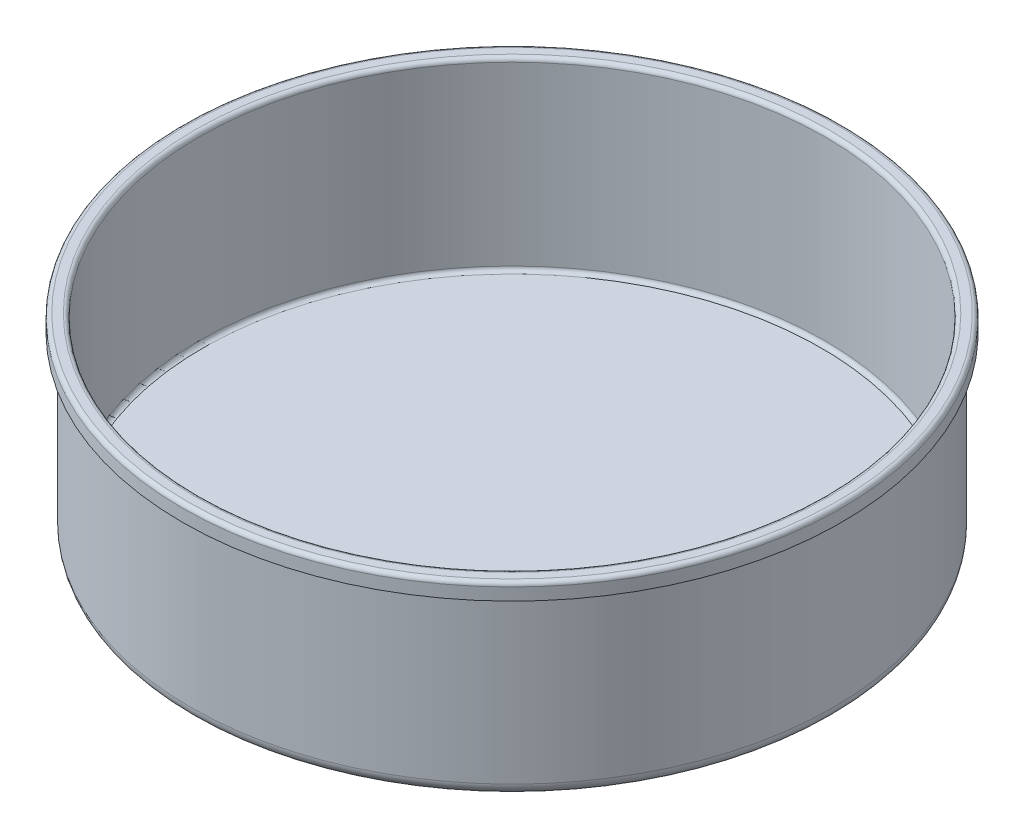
ISO-10303-21;
HEADER;
FILE_DESCRIPTION(('STEP AP214'),'2;1');
FILE_NAME('part.step','',(''),(''),'','','');
FILE_SCHEMA(('AUTOMOTIVE_DESIGN { 1 0 10303 214 1 1 1 1 }'));
ENDSEC;
DATA;
#1=APPLICATION_CONTEXT('core data for automotive mechanical design processes');
#2=APPLICATION_PROTOCOL_DEFINITION('international standard','automotive_design',2000,#1);
#3=PRODUCT_CONTEXT('',#1,'mechanical');
#4=PRODUCT('Part','Part','',(#3));
#5=PRODUCT_RELATED_PRODUCT_CATEGORY('part','',(#4));
#6=PRODUCT_DEFINITION_FORMATION('','',#4);
#7=PRODUCT_DEFINITION_CONTEXT('part definition',#1,'design');
#8=PRODUCT_DEFINITION('design','',#6,#7);
#9=PRODUCT_DEFINITION_SHAPE('','',#8);
#10=(LENGTH_UNIT() NAMED_UNIT(*) SI_UNIT(.MILLI.,.METRE.));
#11=(NAMED_UNIT(*) PLANE_ANGLE_UNIT() SI_UNIT($,.RADIAN.));
#12=(NAMED_UNIT(*) SI_UNIT($,.STERADIAN.) SOLID_ANGLE_UNIT());
#13=UNCERTAINTY_MEASURE_WITH_UNIT(LENGTH_MEASURE(1.E-05),#10,'distance_accuracy_value','');
#14=(GEOMETRIC_REPRESENTATION_CONTEXT(3) GLOBAL_UNCERTAINTY_ASSIGNED_CONTEXT((#13)) GLOBAL_UNIT_ASSIGNED_CONTEXT((#10,
#11,#12)) REPRESENTATION_CONTEXT('',''));
#15=CARTESIAN_POINT('',(0.,0.,0.));
#16=DIRECTION('',(0.,0.,1.));
#17=DIRECTION('',(1.,0.,0.));
#18=AXIS2_PLACEMENT_3D('',#15,#16,#17);
#19=CARTESIAN_POINT('',(0.,60.,0.));
#20=DIRECTION('',(0.,1.,0.));
#21=DIRECTION('',(0.,0.,1.));
#22=AXIS2_PLACEMENT_3D('',#19,#20,#21);
#23=PLANE('',#22);
#24=CARTESIAN_POINT('',(0.,60.,0.));
#25=DIRECTION('',(0.,1.,0.));
#26=DIRECTION('',(0.,0.,1.));
#27=AXIS2_PLACEMENT_3D('',#24,#25,#26);
#28=CIRCLE('',#27,101.27);
#29=CARTESIAN_POINT('',(0.,60.,101.27));
#30=VERTEX_POINT('',#29);
#31=EDGE_CURVE('E41',#30,#30,#28,.T.);
#32=ORIENTED_EDGE('',*,*,#31,.T.);
#33=EDGE_LOOP('',(#32));
#34=FACE_BOUND('',#33,.T.);
#35=CARTESIAN_POINT('',(0.,60.,0.));
#36=DIRECTION('',(0.,1.,0.));
#37=DIRECTION('',(0.,0.,1.));
#38=AXIS2_PLACEMENT_3D('',#35,#36,#37);
#39=CIRCLE('',#38,98.73);
#40=CARTESIAN_POINT('',(0.,60.,98.73));
#41=VERTEX_POINT('',#40);
#42=EDGE_CURVE('E45',#41,#41,#39,.F.);
#43=ORIENTED_EDGE('',*,*,#42,.T.);
#44=EDGE_LOOP('',(#43));
#45=FACE_BOUND('',#44,.T.);
#46=ADVANCED_FACE('F30',(#34,#45),#23,.T.);
#47=CARTESIAN_POINT('',(0.,60.,0.));
#48=DIRECTION('',(0.,-1.,0.));
#49=DIRECTION('',(0.,0.,-1.));
#50=AXIS2_PLACEMENT_3D('',#47,#48,#49);
#51=CYLINDRICAL_SURFACE('',#50,97.46);
#52=CARTESIAN_POINT('',(0.,58.73,0.));
#53=DIRECTION('',(0.,1.,0.));
#54=DIRECTION('',(0.,0.,1.));
#55=AXIS2_PLACEMENT_3D('',#52,#53,#54);
#56=CIRCLE('',#55,97.46);
#57=CARTESIAN_POINT('',(0.,58.73,97.46));
#58=VERTEX_POINT('',#57);
#59=EDGE_CURVE('E10',#58,#58,#56,.T.);
#60=ORIENTED_EDGE('',*,*,#59,.T.);
#61=EDGE_LOOP('',(#60));
#62=FACE_BOUND('',#61,.T.);
#63=CARTESIAN_POINT('',(0.,3.81,0.));
#64=DIRECTION('',(0.,-1.,0.));
#65=DIRECTION('',(0.,0.,-1.));
#66=AXIS2_PLACEMENT_3D('',#63,#64,#65);
#67=CIRCLE('',#66,97.46);
#68=CARTESIAN_POINT('',(0.,3.81,-97.46));
#69=VERTEX_POINT('',#68);
#70=EDGE_CURVE('E60',#69,#69,#67,.F.);
#71=ORIENTED_EDGE('',*,*,#70,.F.);
#72=EDGE_LOOP('',(#71));
#73=FACE_BOUND('',#72,.T.);
#74=ADVANCED_FACE('F94',(#62,#73),#51,.F.);
#75=CARTESIAN_POINT('',(0.,2.54,0.));
#76=DIRECTION('',(0.,1.,0.));
#77=DIRECTION('',(0.,0.,1.));
#78=AXIS2_PLACEMENT_3D('',#75,#76,#77);
#79=PLANE('',#78);
#80=CARTESIAN_POINT('',(0.,2.54,0.));
#81=DIRECTION('',(0.,1.,0.));
#82=DIRECTION('',(0.,0.,1.));
#83=AXIS2_PLACEMENT_3D('',#80,#81,#82);
#84=CIRCLE('',#83,96.19);
#85=CARTESIAN_POINT('',(0.,2.54,96.19));
#86=VERTEX_POINT('',#85);
#87=EDGE_CURVE('E57',#86,#86,#84,.F.);
#88=ORIENTED_EDGE('',*,*,#87,.F.);
#89=EDGE_LOOP('',(#88));
#90=FACE_BOUND('',#89,.T.);
#91=ADVANCED_FACE('F100',(#90),#79,.T.);
#92=CARTESIAN_POINT('',(0.,3.81,0.));
#93=DIRECTION('',(0.,1.,0.));
#94=DIRECTION('',(0.,0.,1.));
#95=AXIS2_PLACEMENT_3D('',#92,#93,#94);
#96=TOROIDAL_SURFACE('',#95,96.19,1.27);
#97=ORIENTED_EDGE('',*,*,#87,.T.);
#98=EDGE_LOOP('',(#97));
#99=FACE_BOUND('',#98,.T.);
#100=ORIENTED_EDGE('',*,*,#70,.T.);
#101=EDGE_LOOP('',(#100));
#102=FACE_BOUND('',#101,.T.);
#103=ADVANCED_FACE('F74',(#99,#102),#96,.F.);
#104=CARTESIAN_POINT('',(0.,54.92,0.));
#105=DIRECTION('',(0.,1.,0.));
#106=DIRECTION('',(0.,0.,1.));
#107=AXIS2_PLACEMENT_3D('',#104,#105,#106);
#108=PLANE('',#107);
#109=CARTESIAN_POINT('',(0.,54.92,0.));
#110=DIRECTION('',(0.,1.,0.));
#111=DIRECTION('',(0.,0.,1.));
#112=AXIS2_PLACEMENT_3D('',#109,#110,#111);
#113=CIRCLE('',#112,102.54);
#114=CARTESIAN_POINT('',(0.,54.92,102.54));
#115=VERTEX_POINT('',#114);
#116=EDGE_CURVE('E63',#115,#115,#113,.T.);
#117=ORIENTED_EDGE('',*,*,#116,.F.);
#118=EDGE_LOOP('',(#117));
#119=FACE_BOUND('',#118,.T.);
#120=CARTESIAN_POINT('',(0.,54.92,0.));
#121=DIRECTION('',(0.,1.,0.));
#122=DIRECTION('',(0.,0.,1.));
#123=AXIS2_PLACEMENT_3D('',#120,#121,#122);
#124=CIRCLE('',#123,100.);
#125=CARTESIAN_POINT('',(0.,54.92,100.));
#126=VERTEX_POINT('',#125);
#127=EDGE_CURVE('E50',#126,#126,#124,.T.);
#128=ORIENTED_EDGE('',*,*,#127,.T.);
#129=EDGE_LOOP('',(#128));
#130=FACE_BOUND('',#129,.T.);
#131=ADVANCED_FACE('F71',(#119,#130),#108,.F.);
#132=CARTESIAN_POINT('',(0.,54.92,0.));
#133=DIRECTION('',(0.,1.,0.));
#134=DIRECTION('',(0.,0.,1.));
#135=AXIS2_PLACEMENT_3D('',#132,#133,#134);
#136=CYLINDRICAL_SURFACE('',#135,102.54);
#137=CARTESIAN_POINT('',(0.,58.73,0.));
#138=DIRECTION('',(0.,1.,0.));
#139=DIRECTION('',(0.,0.,1.));
#140=AXIS2_PLACEMENT_3D('',#137,#138,#139);
#141=CIRCLE('',#140,102.54);
#142=CARTESIAN_POINT('',(0.,58.73,102.54));
#143=VERTEX_POINT('',#142);
#144=EDGE_CURVE('E37',#143,#143,#141,.F.);
#145=ORIENTED_EDGE('',*,*,#144,.T.);
#146=EDGE_LOOP('',(#145));
#147=FACE_BOUND('',#146,.T.);
#148=ORIENTED_EDGE('',*,*,#116,.T.);
#149=EDGE_LOOP('',(#148));
#150=FACE_BOUND('',#149,.T.);
#151=ADVANCED_FACE('F69',(#147,#150),#136,.T.);
#152=CARTESIAN_POINT('',(0.,0.,0.));
#153=DIRECTION('',(0.,1.,0.));
#154=DIRECTION('',(0.,0.,1.));
#155=AXIS2_PLACEMENT_3D('',#152,#153,#154);
#156=PLANE('',#155);
#157=CARTESIAN_POINT('',(0.,0.,0.));
#158=DIRECTION('',(0.,1.,0.));
#159=DIRECTION('',(0.,0.,1.));
#160=AXIS2_PLACEMENT_3D('',#157,#158,#159);
#161=CIRCLE('',#160,96.19);
#162=CARTESIAN_POINT('',(0.,0.,96.19));
#163=VERTEX_POINT('',#162);
#164=EDGE_CURVE('E51',#163,#163,#161,.F.);
#165=ORIENTED_EDGE('',*,*,#164,.T.);
#166=EDGE_LOOP('',(#165));
#167=FACE_BOUND('',#166,.T.);
#168=ADVANCED_FACE('F89',(#167),#156,.F.);
#169=CARTESIAN_POINT('',(0.,3.81,0.));
#170=DIRECTION('',(0.,1.,0.));
#171=DIRECTION('',(0.,0.,1.));
#172=AXIS2_PLACEMENT_3D('',#169,#170,#171);
#173=TOROIDAL_SURFACE('',#172,96.19,3.81);
#174=ORIENTED_EDGE('',*,*,#164,.F.);
#175=EDGE_LOOP('',(#174));
#176=FACE_BOUND('',#175,.T.);
#177=CARTESIAN_POINT('',(0.,3.81,0.));
#178=DIRECTION('',(0.,1.,0.));
#179=DIRECTION('',(0.,0.,1.));
#180=AXIS2_PLACEMENT_3D('',#177,#178,#179);
#181=CIRCLE('',#180,100.);
#182=CARTESIAN_POINT('',(0.,3.81,100.));
#183=VERTEX_POINT('',#182);
#184=EDGE_CURVE('E54',#183,#183,#181,.T.);
#185=ORIENTED_EDGE('',*,*,#184,.F.);
#186=EDGE_LOOP('',(#185));
#187=FACE_BOUND('',#186,.T.);
#188=ADVANCED_FACE('F81',(#176,#187),#173,.T.);
#189=CARTESIAN_POINT('',(0.,60.,0.));
#190=DIRECTION('',(0.,-1.,0.));
#191=DIRECTION('',(0.,0.,-1.));
#192=AXIS2_PLACEMENT_3D('',#189,#190,#191);
#193=CYLINDRICAL_SURFACE('',#192,100.);
#194=ORIENTED_EDGE('',*,*,#184,.T.);
#195=EDGE_LOOP('',(#194));
#196=FACE_BOUND('',#195,.T.);
#197=ORIENTED_EDGE('',*,*,#127,.F.);
#198=EDGE_LOOP('',(#197));
#199=FACE_BOUND('',#198,.T.);
#200=ADVANCED_FACE('F78',(#196,#199),#193,.T.);
#201=CARTESIAN_POINT('',(0.,58.73,0.));
#202=DIRECTION('',(0.,1.,0.));
#203=DIRECTION('',(0.,0.,1.));
#204=AXIS2_PLACEMENT_3D('',#201,#202,#203);
#205=TOROIDAL_SURFACE('',#204,101.27,1.27);
#206=ORIENTED_EDGE('',*,*,#144,.F.);
#207=EDGE_LOOP('',(#206));
#208=FACE_BOUND('',#207,.T.);
#209=ORIENTED_EDGE('',*,*,#31,.F.);
#210=EDGE_LOOP('',(#209));
#211=FACE_BOUND('',#210,.T.);
#212=ADVANCED_FACE('F80',(#208,#211),#205,.T.);
#213=CARTESIAN_POINT('',(0.,58.73,0.));
#214=DIRECTION('',(0.,1.,0.));
#215=DIRECTION('',(0.,0.,1.));
#216=AXIS2_PLACEMENT_3D('',#213,#214,#215);
#217=TOROIDAL_SURFACE('',#216,98.73,1.27);
#218=ORIENTED_EDGE('',*,*,#42,.F.);
#219=EDGE_LOOP('',(#218));
#220=FACE_BOUND('',#219,.T.);
#221=ORIENTED_EDGE('',*,*,#59,.F.);
#222=EDGE_LOOP('',(#221));
#223=FACE_BOUND('',#222,.T.);
#224=ADVANCED_FACE('F32',(#220,#223),#217,.T.);
#225=CLOSED_SHELL('',(#46,#74,#91,#103,#131,#151,#168,#188,#200,#212,#224));
#226=MANIFOLD_SOLID_BREP('B2',#225);
#227=ADVANCED_BREP_SHAPE_REPRESENTATION('',(#18,#226),#14);
#228=SHAPE_DEFINITION_REPRESENTATION(#9,#227);
ENDSEC;
END-ISO-10303-21;
